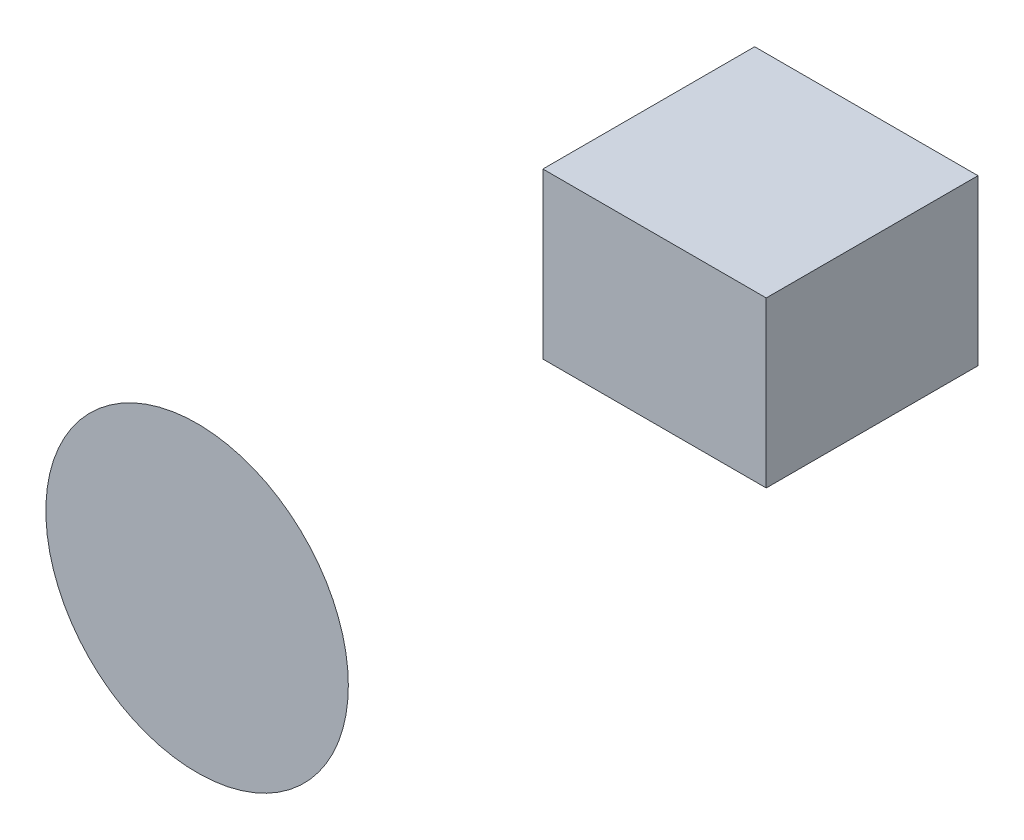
from build123d import *

# Parameters (mm, degrees)
SKETCH1_W      = 80.095024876
SKETCH1_H      = 59.031509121
EXTRUDE1_DEPTH = 75.946


with BuildPart() as part:
    # Sketch1 → Extrude1 (new body)
    with BuildSketch(Plane.XY):
        with Locations((40.047512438, 29.515754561)):
            Rectangle(SKETCH1_W, SKETCH1_H)
    extrude(amount=-EXTRUDE1_DEPTH)


solid = part.part
